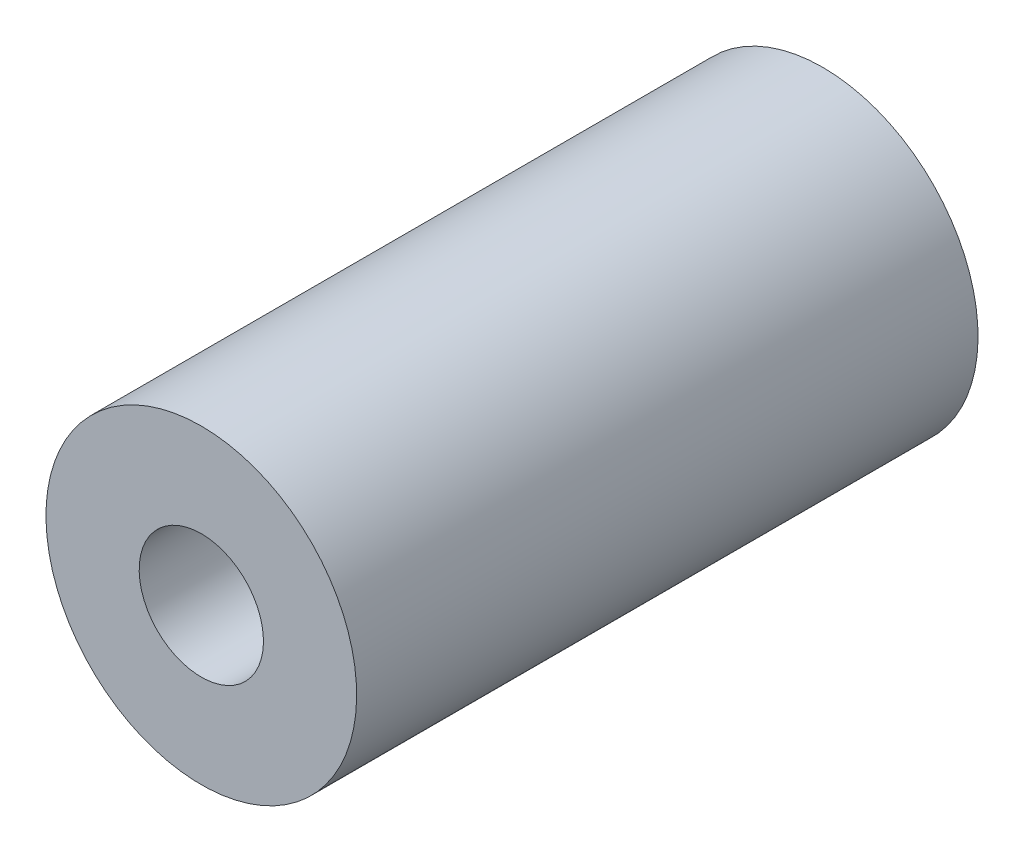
ISO-10303-21;
HEADER;
FILE_DESCRIPTION(('STEP AP214'),'2;1');
FILE_NAME('part.step','',(''),(''),'','','');
FILE_SCHEMA(('AUTOMOTIVE_DESIGN { 1 0 10303 214 1 1 1 1 }'));
ENDSEC;
DATA;
#1=APPLICATION_CONTEXT('core data for automotive mechanical design processes');
#2=APPLICATION_PROTOCOL_DEFINITION('international standard','automotive_design',2000,#1);
#3=PRODUCT_CONTEXT('',#1,'mechanical');
#4=PRODUCT('Part','Part','',(#3));
#5=PRODUCT_RELATED_PRODUCT_CATEGORY('part','',(#4));
#6=PRODUCT_DEFINITION_FORMATION('','',#4);
#7=PRODUCT_DEFINITION_CONTEXT('part definition',#1,'design');
#8=PRODUCT_DEFINITION('design','',#6,#7);
#9=PRODUCT_DEFINITION_SHAPE('','',#8);
#10=(LENGTH_UNIT() NAMED_UNIT(*) SI_UNIT(.MILLI.,.METRE.));
#11=(NAMED_UNIT(*) PLANE_ANGLE_UNIT() SI_UNIT($,.RADIAN.));
#12=(NAMED_UNIT(*) SI_UNIT($,.STERADIAN.) SOLID_ANGLE_UNIT());
#13=UNCERTAINTY_MEASURE_WITH_UNIT(LENGTH_MEASURE(1.E-05),#10,'distance_accuracy_value','');
#14=(GEOMETRIC_REPRESENTATION_CONTEXT(3) GLOBAL_UNCERTAINTY_ASSIGNED_CONTEXT((#13)) GLOBAL_UNIT_ASSIGNED_CONTEXT((#10,
#11,#12)) REPRESENTATION_CONTEXT('',''));
#15=CARTESIAN_POINT('',(0.,0.,0.));
#16=DIRECTION('',(0.,0.,1.));
#17=DIRECTION('',(1.,0.,0.));
#18=AXIS2_PLACEMENT_3D('',#15,#16,#17);
#19=CARTESIAN_POINT('',(0.,0.,0.));
#20=DIRECTION('',(0.,0.,-1.));
#21=DIRECTION('',(0.,1.,0.));
#22=AXIS2_PLACEMENT_3D('',#19,#20,#21);
#23=CYLINDRICAL_SURFACE('',#22,10.);
#24=CARTESIAN_POINT('',(0.,0.,40.));
#25=DIRECTION('',(0.,0.,-1.));
#26=DIRECTION('',(0.,1.,0.));
#27=AXIS2_PLACEMENT_3D('',#24,#25,#26);
#28=CIRCLE('',#27,10.);
#29=CARTESIAN_POINT('',(0.,10.,40.));
#30=VERTEX_POINT('',#29);
#31=EDGE_CURVE('E22',#30,#30,#28,.T.);
#32=ORIENTED_EDGE('',*,*,#31,.T.);
#33=EDGE_LOOP('',(#32));
#34=FACE_BOUND('',#33,.T.);
#35=CARTESIAN_POINT('',(0.,0.,0.));
#36=DIRECTION('',(0.,0.,-1.));
#37=DIRECTION('',(0.,1.,0.));
#38=AXIS2_PLACEMENT_3D('',#35,#36,#37);
#39=CIRCLE('',#38,10.);
#40=CARTESIAN_POINT('',(0.,10.,0.));
#41=VERTEX_POINT('',#40);
#42=EDGE_CURVE('E8',#41,#41,#39,.T.);
#43=ORIENTED_EDGE('',*,*,#42,.F.);
#44=EDGE_LOOP('',(#43));
#45=FACE_BOUND('',#44,.T.);
#46=ADVANCED_FACE('F12',(#34,#45),#23,.T.);
#47=CARTESIAN_POINT('',(0.,0.,0.));
#48=DIRECTION('',(0.,0.,-1.));
#49=DIRECTION('',(0.,1.,0.));
#50=AXIS2_PLACEMENT_3D('',#47,#48,#49);
#51=PLANE('',#50);
#52=ORIENTED_EDGE('',*,*,#42,.T.);
#53=EDGE_LOOP('',(#52));
#54=FACE_BOUND('',#53,.T.);
#55=ADVANCED_FACE('F37',(#54),#51,.T.);
#56=CARTESIAN_POINT('',(0.,0.,0.));
#57=DIRECTION('',(0.,0.,-1.));
#58=DIRECTION('',(0.,1.,0.));
#59=AXIS2_PLACEMENT_3D('',#56,#57,#58);
#60=CYLINDRICAL_SURFACE('',#59,4.);
#61=CARTESIAN_POINT('',(0.,0.,40.));
#62=DIRECTION('',(0.,0.,-1.));
#63=DIRECTION('',(0.,1.,0.));
#64=AXIS2_PLACEMENT_3D('',#61,#62,#63);
#65=CIRCLE('',#64,4.);
#66=CARTESIAN_POINT('',(0.,4.,40.));
#67=VERTEX_POINT('',#66);
#68=EDGE_CURVE('E18',#67,#67,#65,.T.);
#69=ORIENTED_EDGE('',*,*,#68,.F.);
#70=EDGE_LOOP('',(#69));
#71=FACE_BOUND('',#70,.T.);
#72=CARTESIAN_POINT('',(0.,0.,26.));
#73=DIRECTION('',(0.,0.,1.));
#74=DIRECTION('',(1.,0.,0.));
#75=AXIS2_PLACEMENT_3D('',#72,#73,#74);
#76=CIRCLE('',#75,4.);
#77=CARTESIAN_POINT('',(4.,0.,26.));
#78=VERTEX_POINT('',#77);
#79=EDGE_CURVE('E26',#78,#78,#76,.T.);
#80=ORIENTED_EDGE('',*,*,#79,.F.);
#81=EDGE_LOOP('',(#80));
#82=FACE_BOUND('',#81,.T.);
#83=ADVANCED_FACE('F34',(#71,#82),#60,.F.);
#84=CARTESIAN_POINT('',(4.,0.,40.));
#85=DIRECTION('',(0.,0.,1.));
#86=DIRECTION('',(0.,-1.,0.));
#87=AXIS2_PLACEMENT_3D('',#84,#85,#86);
#88=PLANE('',#87);
#89=ORIENTED_EDGE('',*,*,#31,.F.);
#90=EDGE_LOOP('',(#89));
#91=FACE_BOUND('',#90,.T.);
#92=ORIENTED_EDGE('',*,*,#68,.T.);
#93=EDGE_LOOP('',(#92));
#94=FACE_BOUND('',#93,.T.);
#95=ADVANCED_FACE('F36',(#91,#94),#88,.T.);
#96=CARTESIAN_POINT('',(0.,0.,26.));
#97=DIRECTION('',(0.,0.,1.));
#98=DIRECTION('',(0.,-1.,0.));
#99=AXIS2_PLACEMENT_3D('',#96,#97,#98);
#100=PLANE('',#99);
#101=ORIENTED_EDGE('',*,*,#79,.T.);
#102=EDGE_LOOP('',(#101));
#103=FACE_BOUND('',#102,.T.);
#104=ADVANCED_FACE('F32',(#103),#100,.T.);
#105=CLOSED_SHELL('',(#46,#55,#83,#95,#104));
#106=MANIFOLD_SOLID_BREP('B1',#105);
#107=ADVANCED_BREP_SHAPE_REPRESENTATION('',(#18,#106),#14);
#108=SHAPE_DEFINITION_REPRESENTATION(#9,#107);
ENDSEC;
END-ISO-10303-21;
